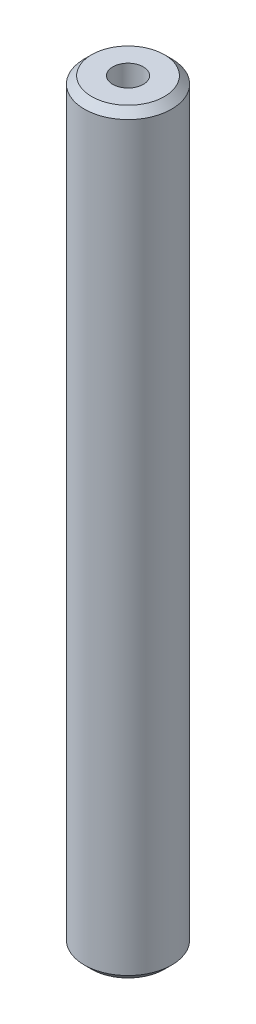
ISO-10303-21;
HEADER;
FILE_DESCRIPTION(('STEP AP214'),'2;1');
FILE_NAME('part.step','',(''),(''),'','','');
FILE_SCHEMA(('AUTOMOTIVE_DESIGN { 1 0 10303 214 1 1 1 1 }'));
ENDSEC;
DATA;
#1=APPLICATION_CONTEXT('core data for automotive mechanical design processes');
#2=APPLICATION_PROTOCOL_DEFINITION('international standard','automotive_design',2000,#1);
#3=PRODUCT_CONTEXT('',#1,'mechanical');
#4=PRODUCT('Part','Part','',(#3));
#5=PRODUCT_RELATED_PRODUCT_CATEGORY('part','',(#4));
#6=PRODUCT_DEFINITION_FORMATION('','',#4);
#7=PRODUCT_DEFINITION_CONTEXT('part definition',#1,'design');
#8=PRODUCT_DEFINITION('design','',#6,#7);
#9=PRODUCT_DEFINITION_SHAPE('','',#8);
#10=(LENGTH_UNIT() NAMED_UNIT(*) SI_UNIT(.MILLI.,.METRE.));
#11=(NAMED_UNIT(*) PLANE_ANGLE_UNIT() SI_UNIT($,.RADIAN.));
#12=(NAMED_UNIT(*) SI_UNIT($,.STERADIAN.) SOLID_ANGLE_UNIT());
#13=UNCERTAINTY_MEASURE_WITH_UNIT(LENGTH_MEASURE(1.E-05),#10,'distance_accuracy_value','');
#14=(GEOMETRIC_REPRESENTATION_CONTEXT(3) GLOBAL_UNCERTAINTY_ASSIGNED_CONTEXT((#13)) GLOBAL_UNIT_ASSIGNED_CONTEXT((#10,
#11,#12)) REPRESENTATION_CONTEXT('',''));
#15=CARTESIAN_POINT('',(0.,0.,0.));
#16=DIRECTION('',(0.,0.,1.));
#17=DIRECTION('',(1.,0.,0.));
#18=AXIS2_PLACEMENT_3D('',#15,#16,#17);
#19=CARTESIAN_POINT('',(0.,104.,0.));
#20=DIRECTION('',(0.,-1.,0.));
#21=DIRECTION('',(0.,0.,-1.));
#22=AXIS2_PLACEMENT_3D('',#19,#20,#21);
#23=CYLINDRICAL_SURFACE('',#22,6.);
#24=CARTESIAN_POINT('',(0.,1.00000000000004,0.));
#25=DIRECTION('',(0.,1.,0.));
#26=DIRECTION('',(0.,0.,1.));
#27=AXIS2_PLACEMENT_3D('',#24,#25,#26);
#28=CIRCLE('',#27,6.);
#29=CARTESIAN_POINT('',(0.,1.00000000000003,-6.));
#30=VERTEX_POINT('',#29);
#31=EDGE_CURVE('E9210',#30,#30,#28,.T.);
#32=CARTESIAN_POINT('',(0.,103.,0.));
#33=DIRECTION('',(0.,1.,0.));
#34=DIRECTION('',(0.,0.,1.));
#35=AXIS2_PLACEMENT_3D('',#32,#33,#34);
#36=CIRCLE('',#35,6.);
#37=CARTESIAN_POINT('',(0.,103.,-6.));
#38=VERTEX_POINT('',#37);
#39=EDGE_CURVE('E9207',#38,#38,#36,.F.);
#40=CARTESIAN_POINT('',(0.,1.00000000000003,-6.));
#41=CARTESIAN_POINT('',(0.,2.06250000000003,-6.));
#42=CARTESIAN_POINT('',(0.,3.12500000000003,-6.));
#43=CARTESIAN_POINT('',(0.,5.25000000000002,-6.));
#44=CARTESIAN_POINT('',(0.,6.31250000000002,-6.));
#45=CARTESIAN_POINT('',(0.,8.43750000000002,-6.));
#46=CARTESIAN_POINT('',(0.,9.50000000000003,-6.));
#47=CARTESIAN_POINT('',(0.,11.625,-6.));
#48=CARTESIAN_POINT('',(0.,12.6875,-6.));
#49=CARTESIAN_POINT('',(0.,14.8125,-6.));
#50=CARTESIAN_POINT('',(0.,15.875,-6.));
#51=CARTESIAN_POINT('',(0.,18.,-6.));
#52=CARTESIAN_POINT('',(0.,19.0625,-6.));
#53=CARTESIAN_POINT('',(0.,21.1875,-6.));
#54=CARTESIAN_POINT('',(0.,22.25,-6.));
#55=CARTESIAN_POINT('',(0.,24.375,-6.));
#56=CARTESIAN_POINT('',(0.,25.4375,-6.));
#57=CARTESIAN_POINT('',(0.,27.5625,-6.));
#58=CARTESIAN_POINT('',(0.,28.625,-6.));
#59=CARTESIAN_POINT('',(0.,30.75,-6.));
#60=CARTESIAN_POINT('',(0.,31.8125,-6.));
#61=CARTESIAN_POINT('',(0.,33.9375,-6.));
#62=CARTESIAN_POINT('',(0.,35.,-6.));
#63=CARTESIAN_POINT('',(0.,37.125,-6.));
#64=CARTESIAN_POINT('',(0.,38.1875,-6.));
#65=CARTESIAN_POINT('',(0.,40.3125,-6.));
#66=CARTESIAN_POINT('',(0.,41.375,-6.));
#67=CARTESIAN_POINT('',(0.,43.5,-6.));
#68=CARTESIAN_POINT('',(0.,44.5625,-6.));
#69=CARTESIAN_POINT('',(0.,46.6875,-6.));
#70=CARTESIAN_POINT('',(0.,47.75,-6.));
#71=CARTESIAN_POINT('',(0.,49.875,-6.));
#72=CARTESIAN_POINT('',(0.,50.9375,-6.));
#73=CARTESIAN_POINT('',(0.,53.0625,-6.));
#74=CARTESIAN_POINT('',(0.,54.125,-6.));
#75=CARTESIAN_POINT('',(0.,56.25,-6.));
#76=CARTESIAN_POINT('',(0.,57.3125,-6.));
#77=CARTESIAN_POINT('',(0.,59.4375,-6.));
#78=CARTESIAN_POINT('',(0.,60.5,-6.));
#79=CARTESIAN_POINT('',(0.,62.625,-6.));
#80=CARTESIAN_POINT('',(0.,63.6875,-6.));
#81=CARTESIAN_POINT('',(0.,65.8125,-6.));
#82=CARTESIAN_POINT('',(0.,66.875,-6.));
#83=CARTESIAN_POINT('',(0.,69.,-6.));
#84=CARTESIAN_POINT('',(0.,70.0625,-6.));
#85=CARTESIAN_POINT('',(0.,72.1875,-6.));
#86=CARTESIAN_POINT('',(0.,73.25,-6.));
#87=CARTESIAN_POINT('',(0.,75.375,-6.));
#88=CARTESIAN_POINT('',(0.,76.4375,-6.));
#89=CARTESIAN_POINT('',(0.,78.5625,-6.));
#90=CARTESIAN_POINT('',(0.,79.625,-6.));
#91=CARTESIAN_POINT('',(0.,81.75,-6.));
#92=CARTESIAN_POINT('',(0.,82.8125,-6.));
#93=CARTESIAN_POINT('',(0.,84.9375,-6.));
#94=CARTESIAN_POINT('',(0.,86.,-6.));
#95=CARTESIAN_POINT('',(0.,88.125,-6.));
#96=CARTESIAN_POINT('',(0.,89.1875,-6.));
#97=CARTESIAN_POINT('',(0.,91.3125,-6.));
#98=CARTESIAN_POINT('',(0.,92.375,-6.));
#99=CARTESIAN_POINT('',(0.,94.5,-6.));
#100=CARTESIAN_POINT('',(0.,95.5625,-6.));
#101=CARTESIAN_POINT('',(0.,97.6875,-6.));
#102=CARTESIAN_POINT('',(0.,98.75,-6.));
#103=CARTESIAN_POINT('',(0.,100.875,-6.));
#104=CARTESIAN_POINT('',(0.,101.9375,-6.));
#105=CARTESIAN_POINT('',(0.,103.,-6.));
#106=B_SPLINE_CURVE_WITH_KNOTS('',3,(#40,#41,#42,#43,#44,#45,#46,#47,#48,#49,#50,#51,#52,#53,
#54,#55,#56,#57,#58,#59,#60,#61,#62,#63,#64,#65,#66,#67,#68,#69,#70,#71,#72,#73,#74,#75,#76,#77,
#78,#79,#80,#81,#82,#83,#84,#85,#86,#87,#88,#89,#90,#91,#92,#93,#94,#95,#96,#97,#98,#99,#100,
#101,#102,#103,#104,#105),.UNSPECIFIED.,.F.,.F.,(4,2,2,2,2,2,2,2,2,2,2,2,2,2,2,2,2,2,2,2,2,2,2,
2,2,2,2,2,2,2,2,2,4),(0.,3.1875,6.37499999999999,9.5625,12.75,15.9375,19.125,22.3125,25.5,
28.6875,31.875,35.0625,38.25,41.4375,44.625,47.8125,51.,54.1875,57.375,60.5625,63.75,66.9375,
70.125,73.3125,76.5,79.6875,82.875,86.0625,89.25,92.4375,95.625,98.8125,102.),.UNSPECIFIED.);
#107=EDGE_CURVE('BSEAM9174',#30,#38,#106,.T.);
#108=ORIENTED_EDGE('',*,*,#31,.T.);
#109=ORIENTED_EDGE('',*,*,#39,.T.);
#110=ORIENTED_EDGE('',*,*,#107,.T.);
#111=ORIENTED_EDGE('',*,*,#107,.F.);
#112=EDGE_LOOP('',(#108,#110,#109,#111));
#113=FACE_BOUND('',#112,.T.);
#114=ADVANCED_FACE('F9174',(#113),#23,.T.);
#115=CARTESIAN_POINT('',(0.,104.,0.));
#116=DIRECTION('',(0.,1.,0.));
#117=DIRECTION('',(0.,0.,1.));
#118=AXIS2_PLACEMENT_3D('',#115,#116,#117);
#119=PLANE('',#118);
#120=CARTESIAN_POINT('',(0.,104.,0.));
#121=DIRECTION('',(0.,1.,0.));
#122=DIRECTION('',(0.,0.,1.));
#123=AXIS2_PLACEMENT_3D('',#120,#121,#122);
#124=CIRCLE('',#123,2.09999999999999);
#125=CARTESIAN_POINT('',(0.,104.,2.09999999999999));
#126=VERTEX_POINT('',#125);
#127=EDGE_CURVE('E9204',#126,#126,#124,.T.);
#128=ORIENTED_EDGE('',*,*,#127,.F.);
#129=EDGE_LOOP('',(#128));
#130=FACE_BOUND('',#129,.T.);
#131=CARTESIAN_POINT('',(0.,104.,0.));
#132=DIRECTION('',(0.,1.,0.));
#133=DIRECTION('',(0.,0.,1.));
#134=AXIS2_PLACEMENT_3D('',#131,#132,#133);
#135=CIRCLE('',#134,5.);
#136=CARTESIAN_POINT('',(0.,104.,5.));
#137=VERTEX_POINT('',#136);
#138=EDGE_CURVE('E11',#137,#137,#135,.T.);
#139=ORIENTED_EDGE('',*,*,#138,.T.);
#140=EDGE_LOOP('',(#139));
#141=FACE_BOUND('',#140,.T.);
#142=ADVANCED_FACE('F9226',(#130,#141),#119,.T.);
#143=CARTESIAN_POINT('',(0.,0.,0.));
#144=DIRECTION('',(0.,1.,0.));
#145=DIRECTION('',(0.,0.,1.));
#146=AXIS2_PLACEMENT_3D('',#143,#144,#145);
#147=PLANE('',#146);
#148=CARTESIAN_POINT('',(0.,0.,0.));
#149=DIRECTION('',(0.,-1.,0.));
#150=DIRECTION('',(0.,0.,-1.));
#151=AXIS2_PLACEMENT_3D('',#148,#149,#150);
#152=CIRCLE('',#151,2.09999999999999);
#153=CARTESIAN_POINT('',(0.,0.,-2.09999999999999));
#154=VERTEX_POINT('',#153);
#155=EDGE_CURVE('E9196',#154,#154,#152,.T.);
#156=ORIENTED_EDGE('',*,*,#155,.F.);
#157=EDGE_LOOP('',(#156));
#158=FACE_BOUND('',#157,.T.);
#159=CARTESIAN_POINT('',(0.,0.,0.));
#160=DIRECTION('',(0.,1.,0.));
#161=DIRECTION('',(0.,0.,1.));
#162=AXIS2_PLACEMENT_3D('',#159,#160,#161);
#163=CIRCLE('',#162,4.99999999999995);
#164=CARTESIAN_POINT('',(0.,0.,4.99999999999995));
#165=VERTEX_POINT('',#164);
#166=EDGE_CURVE('E9181',#165,#165,#163,.F.);
#167=ORIENTED_EDGE('',*,*,#166,.T.);
#168=EDGE_LOOP('',(#167));
#169=FACE_BOUND('',#168,.T.);
#170=ADVANCED_FACE('F9215',(#158,#169),#147,.F.);
#171=CARTESIAN_POINT('',(0.,1.00000000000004,0.));
#172=DIRECTION('',(0.,1.,0.));
#173=DIRECTION('',(0.,0.,1.));
#174=AXIS2_PLACEMENT_3D('',#171,#172,#173);
#175=CONICAL_SURFACE('',#174,6.,0.785398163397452);
#176=ORIENTED_EDGE('',*,*,#166,.F.);
#177=EDGE_LOOP('',(#176));
#178=FACE_BOUND('',#177,.T.);
#179=ORIENTED_EDGE('',*,*,#31,.F.);
#180=EDGE_LOOP('',(#179));
#181=FACE_BOUND('',#180,.T.);
#182=ADVANCED_FACE('F9217',(#178,#181),#175,.T.);
#183=CARTESIAN_POINT('',(0.,104.,0.));
#184=DIRECTION('',(0.,-1.,0.));
#185=DIRECTION('',(0.,0.,-1.));
#186=AXIS2_PLACEMENT_3D('',#183,#184,#185);
#187=CONICAL_SURFACE('',#186,5.,0.785398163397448);
#188=ORIENTED_EDGE('',*,*,#39,.F.);
#189=EDGE_LOOP('',(#188));
#190=FACE_BOUND('',#189,.T.);
#191=ORIENTED_EDGE('',*,*,#138,.F.);
#192=EDGE_LOOP('',(#191));
#193=FACE_BOUND('',#192,.T.);
#194=ADVANCED_FACE('F9220',(#190,#193),#187,.T.);
#195=CARTESIAN_POINT('',(0.,104.,0.));
#196=DIRECTION('',(0.,1.,0.));
#197=DIRECTION('',(0.,0.,1.));
#198=AXIS2_PLACEMENT_3D('',#195,#196,#197);
#199=CYLINDRICAL_SURFACE('',#198,2.09999999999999);
#200=CARTESIAN_POINT('',(0.,91.6,0.));
#201=DIRECTION('',(0.,1.,0.));
#202=DIRECTION('',(0.,0.,1.));
#203=AXIS2_PLACEMENT_3D('',#200,#201,#202);
#204=CIRCLE('',#203,2.09999999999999);
#205=CARTESIAN_POINT('',(0.,91.6,2.09999999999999));
#206=VERTEX_POINT('',#205);
#207=EDGE_CURVE('E9199',#206,#206,#204,.T.);
#208=ORIENTED_EDGE('',*,*,#207,.F.);
#209=EDGE_LOOP('',(#208));
#210=FACE_BOUND('',#209,.T.);
#211=ORIENTED_EDGE('',*,*,#127,.T.);
#212=EDGE_LOOP('',(#211));
#213=FACE_BOUND('',#212,.T.);
#214=ADVANCED_FACE('F9231',(#210,#213),#199,.F.);
#215=CARTESIAN_POINT('',(0.,91.6,0.));
#216=DIRECTION('',(0.,1.,0.));
#217=DIRECTION('',(0.,0.,1.));
#218=AXIS2_PLACEMENT_3D('',#215,#216,#217);
#219=CONICAL_SURFACE('',#218,2.09999999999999,1.02974425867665);
#220=CARTESIAN_POINT('',(0.,90.3381927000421,0.));
#221=VERTEX_POINT('',#220);
#222=VERTEX_LOOP('',#221);
#223=FACE_BOUND('',#222,.T.);
#224=ORIENTED_EDGE('',*,*,#207,.T.);
#225=EDGE_LOOP('',(#224));
#226=FACE_BOUND('',#225,.T.);
#227=ADVANCED_FACE('F9247',(#223,#226),#219,.F.);
#228=CARTESIAN_POINT('',(0.,0.,0.));
#229=DIRECTION('',(0.,-1.,0.));
#230=DIRECTION('',(0.,0.,-1.));
#231=AXIS2_PLACEMENT_3D('',#228,#229,#230);
#232=CYLINDRICAL_SURFACE('',#231,2.09999999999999);
#233=CARTESIAN_POINT('',(0.,12.4,0.));
#234=DIRECTION('',(0.,-1.,0.));
#235=DIRECTION('',(0.,0.,-1.));
#236=AXIS2_PLACEMENT_3D('',#233,#234,#235);
#237=CIRCLE('',#236,2.09999999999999);
#238=CARTESIAN_POINT('',(0.,12.4,-2.09999999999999));
#239=VERTEX_POINT('',#238);
#240=EDGE_CURVE('E9194',#239,#239,#237,.T.);
#241=ORIENTED_EDGE('',*,*,#240,.F.);
#242=EDGE_LOOP('',(#241));
#243=FACE_BOUND('',#242,.T.);
#244=ORIENTED_EDGE('',*,*,#155,.T.);
#245=EDGE_LOOP('',(#244));
#246=FACE_BOUND('',#245,.T.);
#247=ADVANCED_FACE('F9190',(#243,#246),#232,.F.);
#248=CARTESIAN_POINT('',(0.,12.4,0.));
#249=DIRECTION('',(0.,-1.,0.));
#250=DIRECTION('',(0.,0.,-1.));
#251=AXIS2_PLACEMENT_3D('',#248,#249,#250);
#252=CONICAL_SURFACE('',#251,2.09999999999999,1.02974425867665);
#253=CARTESIAN_POINT('',(0.,13.6618072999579,0.));
#254=VERTEX_POINT('',#253);
#255=VERTEX_LOOP('',#254);
#256=FACE_BOUND('',#255,.T.);
#257=ORIENTED_EDGE('',*,*,#240,.T.);
#258=EDGE_LOOP('',(#257));
#259=FACE_BOUND('',#258,.T.);
#260=ADVANCED_FACE('F9187',(#256,#259),#252,.F.);
#261=CLOSED_SHELL('',(#114,#142,#170,#182,#194,#214,#227,#247,#260));
#262=MANIFOLD_SOLID_BREP('B2',#261);
#263=ADVANCED_BREP_SHAPE_REPRESENTATION('',(#18,#262),#14);
#264=SHAPE_DEFINITION_REPRESENTATION(#9,#263);
ENDSEC;
END-ISO-10303-21;
